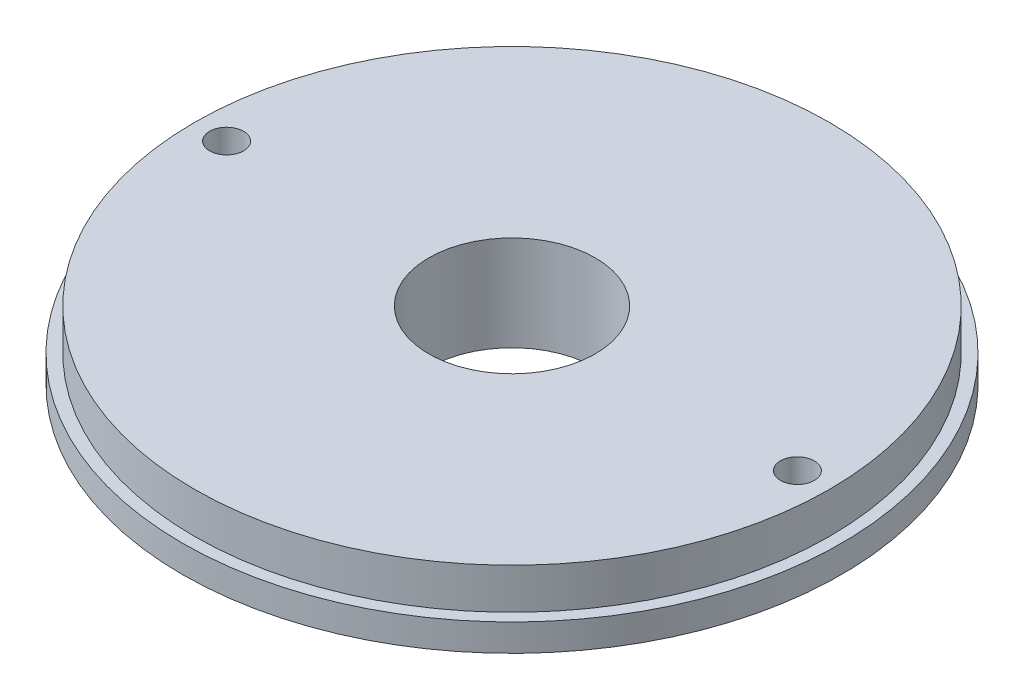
ISO-10303-21;
HEADER;
FILE_DESCRIPTION(('STEP AP214'),'2;1');
FILE_NAME('part.step','',(''),(''),'','','');
FILE_SCHEMA(('AUTOMOTIVE_DESIGN { 1 0 10303 214 1 1 1 1 }'));
ENDSEC;
DATA;
#1=APPLICATION_CONTEXT('core data for automotive mechanical design processes');
#2=APPLICATION_PROTOCOL_DEFINITION('international standard','automotive_design',2000,#1);
#3=PRODUCT_CONTEXT('',#1,'mechanical');
#4=PRODUCT('Part','Part','',(#3));
#5=PRODUCT_RELATED_PRODUCT_CATEGORY('part','',(#4));
#6=PRODUCT_DEFINITION_FORMATION('','',#4);
#7=PRODUCT_DEFINITION_CONTEXT('part definition',#1,'design');
#8=PRODUCT_DEFINITION('design','',#6,#7);
#9=PRODUCT_DEFINITION_SHAPE('','',#8);
#10=(LENGTH_UNIT() NAMED_UNIT(*) SI_UNIT(.MILLI.,.METRE.));
#11=(NAMED_UNIT(*) PLANE_ANGLE_UNIT() SI_UNIT($,.RADIAN.));
#12=(NAMED_UNIT(*) SI_UNIT($,.STERADIAN.) SOLID_ANGLE_UNIT());
#13=UNCERTAINTY_MEASURE_WITH_UNIT(LENGTH_MEASURE(1.E-05),#10,'distance_accuracy_value','');
#14=(GEOMETRIC_REPRESENTATION_CONTEXT(3) GLOBAL_UNCERTAINTY_ASSIGNED_CONTEXT((#13)) GLOBAL_UNIT_ASSIGNED_CONTEXT((#10,
#11,#12)) REPRESENTATION_CONTEXT('',''));
#15=CARTESIAN_POINT('',(0.,0.,0.));
#16=DIRECTION('',(0.,0.,1.));
#17=DIRECTION('',(1.,0.,0.));
#18=AXIS2_PLACEMENT_3D('',#15,#16,#17);
#19=CARTESIAN_POINT('',(-4.44089209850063E-13,0.,0.));
#20=DIRECTION('',(0.,-1.,0.));
#21=DIRECTION('',(0.,0.,-1.));
#22=AXIS2_PLACEMENT_3D('',#19,#20,#21);
#23=CYLINDRICAL_SURFACE('',#22,46.75);
#24=CARTESIAN_POINT('',(-4.44089209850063E-13,70.5,0.));
#25=DIRECTION('',(0.,-1.,0.));
#26=DIRECTION('',(0.,0.,-1.));
#27=AXIS2_PLACEMENT_3D('',#24,#25,#26);
#28=CIRCLE('',#27,46.75);
#29=CARTESIAN_POINT('',(-4.45386783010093E-13,70.5,-46.75));
#30=VERTEX_POINT('',#29);
#31=EDGE_CURVE('E10',#30,#30,#28,.T.);
#32=ORIENTED_EDGE('',*,*,#31,.T.);
#33=EDGE_LOOP('',(#32));
#34=FACE_BOUND('',#33,.T.);
#35=CARTESIAN_POINT('',(-4.44089209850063E-13,64.5,0.));
#36=DIRECTION('',(0.,-1.,0.));
#37=DIRECTION('',(0.,0.,-1.));
#38=AXIS2_PLACEMENT_3D('',#35,#36,#37);
#39=CIRCLE('',#38,46.75);
#40=CARTESIAN_POINT('',(-4.45386783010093E-13,64.5,-46.75));
#41=VERTEX_POINT('',#40);
#42=EDGE_CURVE('E32',#41,#41,#39,.T.);
#43=ORIENTED_EDGE('',*,*,#42,.F.);
#44=EDGE_LOOP('',(#43));
#45=FACE_BOUND('',#44,.T.);
#46=ADVANCED_FACE('F15',(#34,#45),#23,.T.);
#47=CARTESIAN_POINT('',(46.75,70.5,-1.38777878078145E-13));
#48=DIRECTION('',(0.,1.,0.));
#49=DIRECTION('',(0.,0.,1.));
#50=AXIS2_PLACEMENT_3D('',#47,#48,#49);
#51=PLANE('',#50);
#52=CARTESIAN_POINT('',(42.,70.5,-1.11022302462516E-13));
#53=DIRECTION('',(0.,1.,0.));
#54=DIRECTION('',(0.,0.,1.));
#55=AXIS2_PLACEMENT_3D('',#52,#53,#54);
#56=CIRCLE('',#55,2.5);
#57=CARTESIAN_POINT('',(42.,70.5,2.49999999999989));
#58=VERTEX_POINT('',#57);
#59=EDGE_CURVE('E44',#58,#58,#56,.T.);
#60=ORIENTED_EDGE('',*,*,#59,.F.);
#61=EDGE_LOOP('',(#60));
#62=FACE_BOUND('',#61,.T.);
#63=CARTESIAN_POINT('',(-42.,70.5,-1.11022302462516E-13));
#64=DIRECTION('',(0.,1.,0.));
#65=DIRECTION('',(0.,0.,1.));
#66=AXIS2_PLACEMENT_3D('',#63,#64,#65);
#67=CIRCLE('',#66,2.5);
#68=CARTESIAN_POINT('',(-42.,70.5,2.49999999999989));
#69=VERTEX_POINT('',#68);
#70=EDGE_CURVE('E33',#69,#69,#67,.T.);
#71=ORIENTED_EDGE('',*,*,#70,.F.);
#72=EDGE_LOOP('',(#71));
#73=FACE_BOUND('',#72,.T.);
#74=CARTESIAN_POINT('',(-4.44089209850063E-13,70.5,0.));
#75=DIRECTION('',(0.,-1.,0.));
#76=DIRECTION('',(0.,0.,-1.));
#77=AXIS2_PLACEMENT_3D('',#74,#75,#76);
#78=CIRCLE('',#77,12.25);
#79=CARTESIAN_POINT('',(-4.44429215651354E-13,70.5,-12.25));
#80=VERTEX_POINT('',#79);
#81=EDGE_CURVE('E22',#80,#80,#78,.T.);
#82=ORIENTED_EDGE('',*,*,#81,.T.);
#83=EDGE_LOOP('',(#82));
#84=FACE_BOUND('',#83,.T.);
#85=ORIENTED_EDGE('',*,*,#31,.F.);
#86=EDGE_LOOP('',(#85));
#87=FACE_BOUND('',#86,.T.);
#88=ADVANCED_FACE('F77',(#62,#73,#84,#87),#51,.T.);
#89=CARTESIAN_POINT('',(-4.44089209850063E-13,0.,0.));
#90=DIRECTION('',(0.,-1.,0.));
#91=DIRECTION('',(0.,0.,-1.));
#92=AXIS2_PLACEMENT_3D('',#89,#90,#91);
#93=CYLINDRICAL_SURFACE('',#92,12.25);
#94=CARTESIAN_POINT('',(-4.44089209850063E-13,56.5,0.));
#95=DIRECTION('',(0.,-1.,0.));
#96=DIRECTION('',(0.,0.,-1.));
#97=AXIS2_PLACEMENT_3D('',#94,#95,#96);
#98=CIRCLE('',#97,12.25);
#99=CARTESIAN_POINT('',(-4.44429215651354E-13,56.5,-12.2500000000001));
#100=VERTEX_POINT('',#99);
#101=EDGE_CURVE('E27',#100,#100,#98,.T.);
#102=ORIENTED_EDGE('',*,*,#101,.T.);
#103=EDGE_LOOP('',(#102));
#104=FACE_BOUND('',#103,.T.);
#105=ORIENTED_EDGE('',*,*,#81,.F.);
#106=EDGE_LOOP('',(#105));
#107=FACE_BOUND('',#106,.T.);
#108=ADVANCED_FACE('F60',(#104,#107),#93,.F.);
#109=CARTESIAN_POINT('',(12.25,56.5,0.));
#110=DIRECTION('',(0.,-1.,0.));
#111=DIRECTION('',(0.,0.,-1.));
#112=AXIS2_PLACEMENT_3D('',#109,#110,#111);
#113=PLANE('',#112);
#114=CARTESIAN_POINT('',(-4.44089209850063E-13,56.5,0.));
#115=DIRECTION('',(0.,-1.,0.));
#116=DIRECTION('',(0.,0.,-1.));
#117=AXIS2_PLACEMENT_3D('',#114,#115,#116);
#118=CIRCLE('',#117,15.25);
#119=CARTESIAN_POINT('',(-4.44512482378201E-13,56.5,-15.2500000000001));
#120=VERTEX_POINT('',#119);
#121=EDGE_CURVE('E55',#120,#120,#118,.T.);
#122=ORIENTED_EDGE('',*,*,#121,.T.);
#123=EDGE_LOOP('',(#122));
#124=FACE_BOUND('',#123,.T.);
#125=ORIENTED_EDGE('',*,*,#101,.F.);
#126=EDGE_LOOP('',(#125));
#127=FACE_BOUND('',#126,.T.);
#128=ADVANCED_FACE('F63',(#124,#127),#113,.T.);
#129=CARTESIAN_POINT('',(-4.44089209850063E-13,0.,0.));
#130=DIRECTION('',(0.,-1.,0.));
#131=DIRECTION('',(0.,0.,-1.));
#132=AXIS2_PLACEMENT_3D('',#129,#130,#131);
#133=CYLINDRICAL_SURFACE('',#132,15.25);
#134=CARTESIAN_POINT('',(-4.44089209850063E-13,60.5,0.));
#135=DIRECTION('',(0.,-1.,0.));
#136=DIRECTION('',(0.,0.,-1.));
#137=AXIS2_PLACEMENT_3D('',#134,#135,#136);
#138=CIRCLE('',#137,15.25);
#139=CARTESIAN_POINT('',(-4.44512482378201E-13,60.5,-15.25));
#140=VERTEX_POINT('',#139);
#141=EDGE_CURVE('E52',#140,#140,#138,.T.);
#142=ORIENTED_EDGE('',*,*,#141,.T.);
#143=EDGE_LOOP('',(#142));
#144=FACE_BOUND('',#143,.T.);
#145=ORIENTED_EDGE('',*,*,#121,.F.);
#146=EDGE_LOOP('',(#145));
#147=FACE_BOUND('',#146,.T.);
#148=ADVANCED_FACE('F65',(#144,#147),#133,.T.);
#149=CARTESIAN_POINT('',(15.2499999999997,60.5,0.));
#150=DIRECTION('',(0.,-1.,0.));
#151=DIRECTION('',(0.,0.,-1.));
#152=AXIS2_PLACEMENT_3D('',#149,#150,#151);
#153=PLANE('',#152);
#154=CARTESIAN_POINT('',(42.,60.5,0.));
#155=DIRECTION('',(0.,-1.,0.));
#156=DIRECTION('',(0.,0.,-1.));
#157=AXIS2_PLACEMENT_3D('',#154,#155,#156);
#158=CIRCLE('',#157,2.5);
#159=CARTESIAN_POINT('',(42.,60.5,-2.50000000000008));
#160=VERTEX_POINT('',#159);
#161=EDGE_CURVE('E18',#160,#160,#158,.T.);
#162=ORIENTED_EDGE('',*,*,#161,.F.);
#163=EDGE_LOOP('',(#162));
#164=FACE_BOUND('',#163,.T.);
#165=CARTESIAN_POINT('',(-42.,60.5,0.));
#166=DIRECTION('',(0.,-1.,0.));
#167=DIRECTION('',(0.,0.,-1.));
#168=AXIS2_PLACEMENT_3D('',#165,#166,#167);
#169=CIRCLE('',#168,2.5);
#170=CARTESIAN_POINT('',(-42.,60.5,-2.50000000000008));
#171=VERTEX_POINT('',#170);
#172=EDGE_CURVE('E30',#171,#171,#169,.T.);
#173=ORIENTED_EDGE('',*,*,#172,.F.);
#174=EDGE_LOOP('',(#173));
#175=FACE_BOUND('',#174,.T.);
#176=CARTESIAN_POINT('',(-4.44089209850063E-13,60.5,0.));
#177=DIRECTION('',(0.,-1.,0.));
#178=DIRECTION('',(0.,0.,-1.));
#179=AXIS2_PLACEMENT_3D('',#176,#177,#178);
#180=CIRCLE('',#179,48.5);
#181=CARTESIAN_POINT('',(-4.45435355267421E-13,60.5,-48.5));
#182=VERTEX_POINT('',#181);
#183=EDGE_CURVE('E49',#182,#182,#180,.T.);
#184=ORIENTED_EDGE('',*,*,#183,.T.);
#185=EDGE_LOOP('',(#184));
#186=FACE_BOUND('',#185,.T.);
#187=ORIENTED_EDGE('',*,*,#141,.F.);
#188=EDGE_LOOP('',(#187));
#189=FACE_BOUND('',#188,.T.);
#190=ADVANCED_FACE('F74',(#164,#175,#186,#189),#153,.T.);
#191=CARTESIAN_POINT('',(-4.44089209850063E-13,0.,0.));
#192=DIRECTION('',(0.,-1.,0.));
#193=DIRECTION('',(0.,0.,-1.));
#194=AXIS2_PLACEMENT_3D('',#191,#192,#193);
#195=CYLINDRICAL_SURFACE('',#194,48.5);
#196=CARTESIAN_POINT('',(-4.44089209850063E-13,64.5,0.));
#197=DIRECTION('',(0.,-1.,0.));
#198=DIRECTION('',(0.,0.,-1.));
#199=AXIS2_PLACEMENT_3D('',#196,#197,#198);
#200=CIRCLE('',#199,48.5);
#201=CARTESIAN_POINT('',(-4.45435355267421E-13,64.5,-48.5));
#202=VERTEX_POINT('',#201);
#203=EDGE_CURVE('E37',#202,#202,#200,.T.);
#204=ORIENTED_EDGE('',*,*,#203,.T.);
#205=EDGE_LOOP('',(#204));
#206=FACE_BOUND('',#205,.T.);
#207=ORIENTED_EDGE('',*,*,#183,.F.);
#208=EDGE_LOOP('',(#207));
#209=FACE_BOUND('',#208,.T.);
#210=ADVANCED_FACE('F92',(#206,#209),#195,.T.);
#211=CARTESIAN_POINT('',(48.5,64.5,0.));
#212=DIRECTION('',(0.,1.,0.));
#213=DIRECTION('',(0.,0.,1.));
#214=AXIS2_PLACEMENT_3D('',#211,#212,#213);
#215=PLANE('',#214);
#216=ORIENTED_EDGE('',*,*,#42,.T.);
#217=EDGE_LOOP('',(#216));
#218=FACE_BOUND('',#217,.T.);
#219=ORIENTED_EDGE('',*,*,#203,.F.);
#220=EDGE_LOOP('',(#219));
#221=FACE_BOUND('',#220,.T.);
#222=ADVANCED_FACE('F88',(#218,#221),#215,.T.);
#223=CARTESIAN_POINT('',(-42.,70.5,-1.11022302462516E-13));
#224=DIRECTION('',(0.,1.,0.));
#225=DIRECTION('',(0.,0.,1.));
#226=AXIS2_PLACEMENT_3D('',#223,#224,#225);
#227=CYLINDRICAL_SURFACE('',#226,2.5);
#228=ORIENTED_EDGE('',*,*,#172,.T.);
#229=EDGE_LOOP('',(#228));
#230=FACE_BOUND('',#229,.T.);
#231=ORIENTED_EDGE('',*,*,#70,.T.);
#232=EDGE_LOOP('',(#231));
#233=FACE_BOUND('',#232,.T.);
#234=ADVANCED_FACE('F91',(#230,#233),#227,.F.);
#235=CARTESIAN_POINT('',(42.,70.5,-1.11022302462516E-13));
#236=DIRECTION('',(0.,1.,0.));
#237=DIRECTION('',(0.,0.,1.));
#238=AXIS2_PLACEMENT_3D('',#235,#236,#237);
#239=CYLINDRICAL_SURFACE('',#238,2.5);
#240=ORIENTED_EDGE('',*,*,#161,.T.);
#241=EDGE_LOOP('',(#240));
#242=FACE_BOUND('',#241,.T.);
#243=ORIENTED_EDGE('',*,*,#59,.T.);
#244=EDGE_LOOP('',(#243));
#245=FACE_BOUND('',#244,.T.);
#246=ADVANCED_FACE('F116',(#242,#245),#239,.F.);
#247=CLOSED_SHELL('',(#46,#88,#108,#128,#148,#190,#210,#222,#234,#246));
#248=MANIFOLD_SOLID_BREP('B1',#247);
#249=ADVANCED_BREP_SHAPE_REPRESENTATION('',(#18,#248),#14);
#250=SHAPE_DEFINITION_REPRESENTATION(#9,#249);
ENDSEC;
END-ISO-10303-21;
